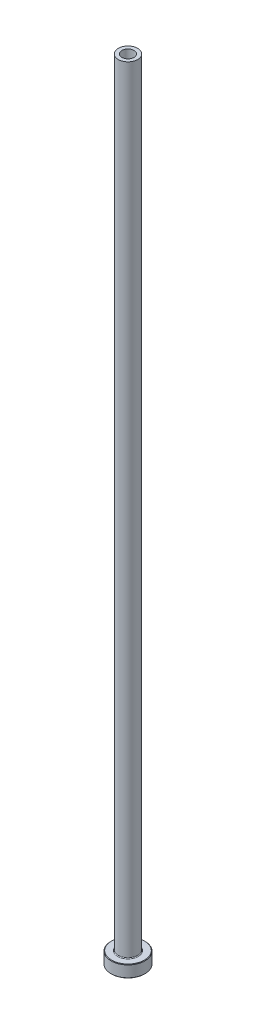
ISO-10303-21;
HEADER;
FILE_DESCRIPTION(('STEP AP214'),'2;1');
FILE_NAME('part.step','',(''),(''),'','','');
FILE_SCHEMA(('AUTOMOTIVE_DESIGN { 1 0 10303 214 1 1 1 1 }'));
ENDSEC;
DATA;
#1=APPLICATION_CONTEXT('core data for automotive mechanical design processes');
#2=APPLICATION_PROTOCOL_DEFINITION('international standard','automotive_design',2000,#1);
#3=PRODUCT_CONTEXT('',#1,'mechanical');
#4=PRODUCT('Part','Part','',(#3));
#5=PRODUCT_RELATED_PRODUCT_CATEGORY('part','',(#4));
#6=PRODUCT_DEFINITION_FORMATION('','',#4);
#7=PRODUCT_DEFINITION_CONTEXT('part definition',#1,'design');
#8=PRODUCT_DEFINITION('design','',#6,#7);
#9=PRODUCT_DEFINITION_SHAPE('','',#8);
#10=(LENGTH_UNIT() NAMED_UNIT(*) SI_UNIT(.MILLI.,.METRE.));
#11=(NAMED_UNIT(*) PLANE_ANGLE_UNIT() SI_UNIT($,.RADIAN.));
#12=(NAMED_UNIT(*) SI_UNIT($,.STERADIAN.) SOLID_ANGLE_UNIT());
#13=UNCERTAINTY_MEASURE_WITH_UNIT(LENGTH_MEASURE(1.E-05),#10,'distance_accuracy_value','');
#14=(GEOMETRIC_REPRESENTATION_CONTEXT(3) GLOBAL_UNCERTAINTY_ASSIGNED_CONTEXT((#13)) GLOBAL_UNIT_ASSIGNED_CONTEXT((#10,
#11,#12)) REPRESENTATION_CONTEXT('',''));
#15=CARTESIAN_POINT('',(0.,0.,0.));
#16=DIRECTION('',(0.,0.,1.));
#17=DIRECTION('',(1.,0.,0.));
#18=AXIS2_PLACEMENT_3D('',#15,#16,#17);
#19=CARTESIAN_POINT('',(0.,92.1876809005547,0.));
#20=DIRECTION('',(0.,1.,0.));
#21=DIRECTION('',(0.,0.,1.));
#22=AXIS2_PLACEMENT_3D('',#19,#20,#21);
#23=CYLINDRICAL_SURFACE('',#22,2.50000000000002);
#24=CARTESIAN_POINT('',(0.,325.,0.));
#25=DIRECTION('',(0.,1.,0.));
#26=DIRECTION('',(0.,0.,1.));
#27=AXIS2_PLACEMENT_3D('',#24,#25,#26);
#28=CIRCLE('',#27,2.50000000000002);
#29=CARTESIAN_POINT('',(0.,325.,2.50000000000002));
#30=VERTEX_POINT('',#29);
#31=EDGE_CURVE('E62',#30,#30,#28,.T.);
#32=ORIENTED_EDGE('',*,*,#31,.T.);
#33=EDGE_LOOP('',(#32));
#34=FACE_BOUND('',#33,.T.);
#35=CARTESIAN_POINT('',(0.,280.,0.));
#36=DIRECTION('',(0.,1.,0.));
#37=DIRECTION('',(0.,0.,1.));
#38=AXIS2_PLACEMENT_3D('',#35,#36,#37);
#39=CIRCLE('',#38,2.50000000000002);
#40=CARTESIAN_POINT('',(0.,280.,2.50000000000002));
#41=VERTEX_POINT('',#40);
#42=EDGE_CURVE('E71',#41,#41,#39,.T.);
#43=ORIENTED_EDGE('',*,*,#42,.F.);
#44=EDGE_LOOP('',(#43));
#45=FACE_BOUND('',#44,.T.);
#46=ADVANCED_FACE('F30',(#34,#45),#23,.F.);
#47=CARTESIAN_POINT('',(-2.50000000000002,325.,0.));
#48=DIRECTION('',(0.,1.,0.));
#49=DIRECTION('',(0.,0.,1.));
#50=AXIS2_PLACEMENT_3D('',#47,#48,#49);
#51=PLANE('',#50);
#52=CARTESIAN_POINT('',(0.,325.,0.));
#53=DIRECTION('',(0.,1.,0.));
#54=DIRECTION('',(0.,0.,1.));
#55=AXIS2_PLACEMENT_3D('',#52,#53,#54);
#56=CIRCLE('',#55,4.00000000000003);
#57=CARTESIAN_POINT('',(0.,325.,4.00000000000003));
#58=VERTEX_POINT('',#57);
#59=EDGE_CURVE('E65',#58,#58,#56,.T.);
#60=ORIENTED_EDGE('',*,*,#59,.T.);
#61=EDGE_LOOP('',(#60));
#62=FACE_BOUND('',#61,.T.);
#63=ORIENTED_EDGE('',*,*,#31,.F.);
#64=EDGE_LOOP('',(#63));
#65=FACE_BOUND('',#64,.T.);
#66=ADVANCED_FACE('F79',(#62,#65),#51,.T.);
#67=CARTESIAN_POINT('',(0.,92.1876809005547,0.));
#68=DIRECTION('',(0.,1.,0.));
#69=DIRECTION('',(0.,0.,1.));
#70=AXIS2_PLACEMENT_3D('',#67,#68,#69);
#71=CYLINDRICAL_SURFACE('',#70,4.00000000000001);
#72=CARTESIAN_POINT('',(0.,5.3,0.));
#73=DIRECTION('',(0.,1.,0.));
#74=DIRECTION('',(0.,0.,1.));
#75=AXIS2_PLACEMENT_3D('',#72,#73,#74);
#76=CIRCLE('',#75,4.00000000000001);
#77=CARTESIAN_POINT('',(0.,5.3,4.00000000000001));
#78=VERTEX_POINT('',#77);
#79=EDGE_CURVE('E59',#78,#78,#76,.T.);
#80=ORIENTED_EDGE('',*,*,#79,.T.);
#81=EDGE_LOOP('',(#80));
#82=FACE_BOUND('',#81,.T.);
#83=ORIENTED_EDGE('',*,*,#59,.F.);
#84=EDGE_LOOP('',(#83));
#85=FACE_BOUND('',#84,.T.);
#86=ADVANCED_FACE('F85',(#82,#85),#71,.T.);
#87=CARTESIAN_POINT('',(-3.99999999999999,5.,0.));
#88=DIRECTION('',(0.,1.,0.));
#89=DIRECTION('',(0.,0.,1.));
#90=AXIS2_PLACEMENT_3D('',#87,#88,#89);
#91=PLANE('',#90);
#92=CARTESIAN_POINT('',(0.,5.,0.));
#93=DIRECTION('',(0.,1.,0.));
#94=DIRECTION('',(0.,0.,1.));
#95=AXIS2_PLACEMENT_3D('',#92,#93,#94);
#96=CIRCLE('',#95,6.79999999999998);
#97=CARTESIAN_POINT('',(0.,5.,6.79999999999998));
#98=VERTEX_POINT('',#97);
#99=EDGE_CURVE('E53',#98,#98,#96,.T.);
#100=ORIENTED_EDGE('',*,*,#99,.T.);
#101=EDGE_LOOP('',(#100));
#102=FACE_BOUND('',#101,.T.);
#103=CARTESIAN_POINT('',(0.,5.,0.));
#104=DIRECTION('',(0.,1.,0.));
#105=DIRECTION('',(0.,0.,1.));
#106=AXIS2_PLACEMENT_3D('',#103,#104,#105);
#107=CIRCLE('',#106,4.30000000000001);
#108=CARTESIAN_POINT('',(0.,5.,4.30000000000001));
#109=VERTEX_POINT('',#108);
#110=EDGE_CURVE('E56',#109,#109,#107,.F.);
#111=ORIENTED_EDGE('',*,*,#110,.T.);
#112=EDGE_LOOP('',(#111));
#113=FACE_BOUND('',#112,.T.);
#114=ADVANCED_FACE('F111',(#102,#113),#91,.T.);
#115=CARTESIAN_POINT('',(0.,92.1876809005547,0.));
#116=DIRECTION('',(0.,1.,0.));
#117=DIRECTION('',(0.,0.,1.));
#118=AXIS2_PLACEMENT_3D('',#115,#116,#117);
#119=CYLINDRICAL_SURFACE('',#118,6.99999999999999);
#120=CARTESIAN_POINT('',(0.,4.8,0.));
#121=DIRECTION('',(0.,1.,0.));
#122=DIRECTION('',(0.,0.,1.));
#123=AXIS2_PLACEMENT_3D('',#120,#121,#122);
#124=CIRCLE('',#123,6.99999999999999);
#125=CARTESIAN_POINT('',(0.,4.8,6.99999999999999));
#126=VERTEX_POINT('',#125);
#127=EDGE_CURVE('E45',#126,#126,#124,.F.);
#128=ORIENTED_EDGE('',*,*,#127,.T.);
#129=EDGE_LOOP('',(#128));
#130=FACE_BOUND('',#129,.T.);
#131=CARTESIAN_POINT('',(0.,0.200000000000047,0.));
#132=DIRECTION('',(0.,-1.,0.));
#133=DIRECTION('',(0.,0.,-1.));
#134=AXIS2_PLACEMENT_3D('',#131,#132,#133);
#135=CIRCLE('',#134,6.99999999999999);
#136=CARTESIAN_POINT('',(0.,0.200000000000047,-6.99999999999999));
#137=VERTEX_POINT('',#136);
#138=EDGE_CURVE('E50',#137,#137,#135,.F.);
#139=ORIENTED_EDGE('',*,*,#138,.T.);
#140=EDGE_LOOP('',(#139));
#141=FACE_BOUND('',#140,.T.);
#142=ADVANCED_FACE('F108',(#130,#141),#119,.T.);
#143=CARTESIAN_POINT('',(-6.99999999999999,0.,0.));
#144=DIRECTION('',(0.,-1.,0.));
#145=DIRECTION('',(0.,0.,-1.));
#146=AXIS2_PLACEMENT_3D('',#143,#144,#145);
#147=PLANE('',#146);
#148=CARTESIAN_POINT('',(0.,0.,0.));
#149=DIRECTION('',(0.,-1.,0.));
#150=DIRECTION('',(0.,0.,-1.));
#151=AXIS2_PLACEMENT_3D('',#148,#149,#150);
#152=CIRCLE('',#151,3.25000000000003);
#153=CARTESIAN_POINT('',(0.,0.,-3.25000000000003));
#154=VERTEX_POINT('',#153);
#155=EDGE_CURVE('E37',#154,#154,#152,.F.);
#156=ORIENTED_EDGE('',*,*,#155,.T.);
#157=EDGE_LOOP('',(#156));
#158=FACE_BOUND('',#157,.T.);
#159=CARTESIAN_POINT('',(0.,0.,0.));
#160=DIRECTION('',(0.,-1.,0.));
#161=DIRECTION('',(0.,0.,-1.));
#162=AXIS2_PLACEMENT_3D('',#159,#160,#161);
#163=CIRCLE('',#162,6.79999999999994);
#164=CARTESIAN_POINT('',(0.,0.,-6.79999999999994));
#165=VERTEX_POINT('',#164);
#166=EDGE_CURVE('E41',#165,#165,#163,.T.);
#167=ORIENTED_EDGE('',*,*,#166,.T.);
#168=EDGE_LOOP('',(#167));
#169=FACE_BOUND('',#168,.T.);
#170=ADVANCED_FACE('F110',(#158,#169),#147,.T.);
#171=CARTESIAN_POINT('',(0.,92.1876809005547,0.));
#172=DIRECTION('',(0.,1.,0.));
#173=DIRECTION('',(0.,0.,1.));
#174=AXIS2_PLACEMENT_3D('',#171,#172,#173);
#175=CYLINDRICAL_SURFACE('',#174,2.75000000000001);
#176=CARTESIAN_POINT('',(0.,0.500000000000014,0.));
#177=DIRECTION('',(0.,-1.,0.));
#178=DIRECTION('',(0.,0.,-1.));
#179=AXIS2_PLACEMENT_3D('',#176,#177,#178);
#180=CIRCLE('',#179,2.75000000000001);
#181=CARTESIAN_POINT('',(0.,0.500000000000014,-2.75000000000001));
#182=VERTEX_POINT('',#181);
#183=EDGE_CURVE('E10',#182,#182,#180,.T.);
#184=ORIENTED_EDGE('',*,*,#183,.T.);
#185=EDGE_LOOP('',(#184));
#186=FACE_BOUND('',#185,.T.);
#187=CARTESIAN_POINT('',(0.,268.,0.));
#188=DIRECTION('',(0.,1.,0.));
#189=DIRECTION('',(0.,0.,1.));
#190=AXIS2_PLACEMENT_3D('',#187,#188,#189);
#191=CIRCLE('',#190,2.75000000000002);
#192=CARTESIAN_POINT('',(0.,268.,2.75000000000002));
#193=VERTEX_POINT('',#192);
#194=EDGE_CURVE('E68',#193,#193,#191,.T.);
#195=ORIENTED_EDGE('',*,*,#194,.T.);
#196=EDGE_LOOP('',(#195));
#197=FACE_BOUND('',#196,.T.);
#198=ADVANCED_FACE('F118',(#186,#197),#175,.F.);
#199=CARTESIAN_POINT('',(0.,268.,0.));
#200=DIRECTION('',(0.,-1.,0.));
#201=DIRECTION('',(0.,0.,-1.));
#202=AXIS2_PLACEMENT_3D('',#199,#200,#201);
#203=CONICAL_SURFACE('',#202,2.75000000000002,0.0208303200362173);
#204=ORIENTED_EDGE('',*,*,#42,.T.);
#205=EDGE_LOOP('',(#204));
#206=FACE_BOUND('',#205,.T.);
#207=ORIENTED_EDGE('',*,*,#194,.F.);
#208=EDGE_LOOP('',(#207));
#209=FACE_BOUND('',#208,.T.);
#210=ADVANCED_FACE('F75',(#206,#209),#203,.F.);
#211=CARTESIAN_POINT('',(0.,5.3,0.));
#212=DIRECTION('',(0.,1.,0.));
#213=DIRECTION('',(0.,0.,1.));
#214=AXIS2_PLACEMENT_3D('',#211,#212,#213);
#215=TOROIDAL_SURFACE('',#214,4.30000000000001,0.3);
#216=ORIENTED_EDGE('',*,*,#110,.F.);
#217=EDGE_LOOP('',(#216));
#218=FACE_BOUND('',#217,.T.);
#219=ORIENTED_EDGE('',*,*,#79,.F.);
#220=EDGE_LOOP('',(#219));
#221=FACE_BOUND('',#220,.T.);
#222=ADVANCED_FACE('F90',(#218,#221),#215,.F.);
#223=CARTESIAN_POINT('',(0.,5.,0.));
#224=DIRECTION('',(0.,-1.,0.));
#225=DIRECTION('',(0.,0.,-1.));
#226=AXIS2_PLACEMENT_3D('',#223,#224,#225);
#227=CONICAL_SURFACE('',#226,6.79999999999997,0.785398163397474);
#228=ORIENTED_EDGE('',*,*,#127,.F.);
#229=EDGE_LOOP('',(#228));
#230=FACE_BOUND('',#229,.T.);
#231=ORIENTED_EDGE('',*,*,#99,.F.);
#232=EDGE_LOOP('',(#231));
#233=FACE_BOUND('',#232,.T.);
#234=ADVANCED_FACE('F93',(#230,#233),#227,.T.);
#235=CARTESIAN_POINT('',(0.,0.200000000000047,0.));
#236=DIRECTION('',(0.,1.,0.));
#237=DIRECTION('',(0.,0.,1.));
#238=AXIS2_PLACEMENT_3D('',#235,#236,#237);
#239=CONICAL_SURFACE('',#238,6.99999999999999,0.78539816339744);
#240=ORIENTED_EDGE('',*,*,#166,.F.);
#241=EDGE_LOOP('',(#240));
#242=FACE_BOUND('',#241,.T.);
#243=ORIENTED_EDGE('',*,*,#138,.F.);
#244=EDGE_LOOP('',(#243));
#245=FACE_BOUND('',#244,.T.);
#246=ADVANCED_FACE('F96',(#242,#245),#239,.T.);
#247=CARTESIAN_POINT('',(0.,0.,0.));
#248=DIRECTION('',(0.,-1.,0.));
#249=DIRECTION('',(0.,0.,-1.));
#250=AXIS2_PLACEMENT_3D('',#247,#248,#249);
#251=CONICAL_SURFACE('',#250,3.25000000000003,0.785398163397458);
#252=ORIENTED_EDGE('',*,*,#183,.F.);
#253=EDGE_LOOP('',(#252));
#254=FACE_BOUND('',#253,.T.);
#255=ORIENTED_EDGE('',*,*,#155,.F.);
#256=EDGE_LOOP('',(#255));
#257=FACE_BOUND('',#256,.T.);
#258=ADVANCED_FACE('F32',(#254,#257),#251,.F.);
#259=CLOSED_SHELL('',(#46,#66,#86,#114,#142,#170,#198,#210,#222,#234,#246,#258));
#260=MANIFOLD_SOLID_BREP('B2',#259);
#261=ADVANCED_BREP_SHAPE_REPRESENTATION('',(#18,#260),#14);
#262=SHAPE_DEFINITION_REPRESENTATION(#9,#261);
ENDSEC;
END-ISO-10303-21;
